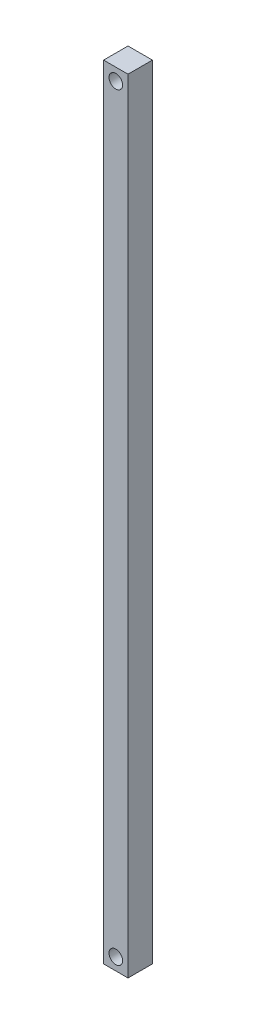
ISO-10303-21;
HEADER;
FILE_DESCRIPTION(('STEP AP214'),'2;1');
FILE_NAME('part.step','',(''),(''),'','','');
FILE_SCHEMA(('AUTOMOTIVE_DESIGN { 1 0 10303 214 1 1 1 1 }'));
ENDSEC;
DATA;
#1=APPLICATION_CONTEXT('core data for automotive mechanical design processes');
#2=APPLICATION_PROTOCOL_DEFINITION('international standard','automotive_design',2000,#1);
#3=PRODUCT_CONTEXT('',#1,'mechanical');
#4=PRODUCT('Part','Part','',(#3));
#5=PRODUCT_RELATED_PRODUCT_CATEGORY('part','',(#4));
#6=PRODUCT_DEFINITION_FORMATION('','',#4);
#7=PRODUCT_DEFINITION_CONTEXT('part definition',#1,'design');
#8=PRODUCT_DEFINITION('design','',#6,#7);
#9=PRODUCT_DEFINITION_SHAPE('','',#8);
#10=(LENGTH_UNIT() NAMED_UNIT(*) SI_UNIT(.MILLI.,.METRE.));
#11=(NAMED_UNIT(*) PLANE_ANGLE_UNIT() SI_UNIT($,.RADIAN.));
#12=(NAMED_UNIT(*) SI_UNIT($,.STERADIAN.) SOLID_ANGLE_UNIT());
#13=UNCERTAINTY_MEASURE_WITH_UNIT(LENGTH_MEASURE(1.E-05),#10,'distance_accuracy_value','');
#14=(GEOMETRIC_REPRESENTATION_CONTEXT(3) GLOBAL_UNCERTAINTY_ASSIGNED_CONTEXT((#13)) GLOBAL_UNIT_ASSIGNED_CONTEXT((#10,
#11,#12)) REPRESENTATION_CONTEXT('',''));
#15=CARTESIAN_POINT('',(0.,0.,0.));
#16=DIRECTION('',(0.,0.,1.));
#17=DIRECTION('',(1.,0.,0.));
#18=AXIS2_PLACEMENT_3D('',#15,#16,#17);
#19=CARTESIAN_POINT('',(0.,0.,18.7));
#20=DIRECTION('',(0.,0.,-1.));
#21=DIRECTION('',(-1.,0.,0.));
#22=AXIS2_PLACEMENT_3D('',#19,#20,#21);
#23=PLANE('',#22);
#24=DIRECTION('',(0.,-1.,0.));
#25=VECTOR('',#24,1.);
#26=CARTESIAN_POINT('',(-3.76965671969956,0.,18.7));
#27=LINE('',#26,#25);
#28=CARTESIAN_POINT('',(-3.76965671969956,600.,18.7));
#29=VERTEX_POINT('',#28);
#30=CARTESIAN_POINT('',(-3.76965671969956,0.,18.7));
#31=VERTEX_POINT('',#30);
#32=EDGE_CURVE('E98',#29,#31,#27,.T.);
#33=ORIENTED_EDGE('',*,*,#32,.T.);
#34=DIRECTION('',(1.,0.,0.));
#35=VECTOR('',#34,1.);
#36=CARTESIAN_POINT('',(-3.76965671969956,0.,18.7));
#37=LINE('',#36,#35);
#38=CARTESIAN_POINT('',(14.9303432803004,0.,18.7));
#39=VERTEX_POINT('',#38);
#40=EDGE_CURVE('E93',#31,#39,#37,.T.);
#41=ORIENTED_EDGE('',*,*,#40,.T.);
#42=DIRECTION('',(0.,1.,0.));
#43=VECTOR('',#42,1.);
#44=CARTESIAN_POINT('',(14.9303432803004,0.,18.7));
#45=LINE('',#44,#43);
#46=CARTESIAN_POINT('',(14.9303432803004,600.,18.7));
#47=VERTEX_POINT('',#46);
#48=EDGE_CURVE('E96',#39,#47,#45,.T.);
#49=ORIENTED_EDGE('',*,*,#48,.T.);
#50=DIRECTION('',(-1.,0.,0.));
#51=VECTOR('',#50,1.);
#52=CARTESIAN_POINT('',(-3.76965671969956,600.,18.7));
#53=LINE('',#52,#51);
#54=EDGE_CURVE('E63',#47,#29,#53,.T.);
#55=ORIENTED_EDGE('',*,*,#54,.T.);
#56=EDGE_LOOP('',(#33,#41,#49,#55));
#57=FACE_BOUND('',#56,.T.);
#58=CARTESIAN_POINT('',(5.58034328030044,590.65,18.7));
#59=DIRECTION('',(0.,0.,1.));
#60=DIRECTION('',(1.,0.,0.));
#61=AXIS2_PLACEMENT_3D('',#58,#59,#60);
#62=CIRCLE('',#61,5.19999999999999);
#63=CARTESIAN_POINT('',(10.7803432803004,590.65,18.7));
#64=VERTEX_POINT('',#63);
#65=EDGE_CURVE('E118',#64,#64,#62,.T.);
#66=ORIENTED_EDGE('',*,*,#65,.F.);
#67=EDGE_LOOP('',(#66));
#68=FACE_BOUND('',#67,.T.);
#69=CARTESIAN_POINT('',(5.58034328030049,9.35,18.7));
#70=DIRECTION('',(0.,0.,1.));
#71=DIRECTION('',(1.,0.,0.));
#72=AXIS2_PLACEMENT_3D('',#69,#70,#71);
#73=CIRCLE('',#72,5.2);
#74=CARTESIAN_POINT('',(10.7803432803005,9.35,18.7));
#75=VERTEX_POINT('',#74);
#76=EDGE_CURVE('E140',#75,#75,#73,.T.);
#77=ORIENTED_EDGE('',*,*,#76,.F.);
#78=EDGE_LOOP('',(#77));
#79=FACE_BOUND('',#78,.T.);
#80=ADVANCED_FACE('F45',(#57,#68,#79),#23,.F.);
#81=CARTESIAN_POINT('',(0.,0.,0.));
#82=DIRECTION('',(0.,0.,-1.));
#83=DIRECTION('',(-1.,0.,0.));
#84=AXIS2_PLACEMENT_3D('',#81,#82,#83);
#85=PLANE('',#84);
#86=CARTESIAN_POINT('',(5.58034328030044,590.65,0.));
#87=DIRECTION('',(0.,0.,1.));
#88=DIRECTION('',(1.,0.,0.));
#89=AXIS2_PLACEMENT_3D('',#86,#87,#88);
#90=CIRCLE('',#89,5.19999999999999);
#91=CARTESIAN_POINT('',(10.7803432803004,590.65,0.));
#92=VERTEX_POINT('',#91);
#93=EDGE_CURVE('E136',#92,#92,#90,.T.);
#94=ORIENTED_EDGE('',*,*,#93,.T.);
#95=EDGE_LOOP('',(#94));
#96=FACE_BOUND('',#95,.T.);
#97=DIRECTION('',(0.,-1.,0.));
#98=VECTOR('',#97,1.);
#99=CARTESIAN_POINT('',(-3.76965671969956,0.,0.));
#100=LINE('',#99,#98);
#101=CARTESIAN_POINT('',(-3.76965671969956,600.,0.));
#102=VERTEX_POINT('',#101);
#103=CARTESIAN_POINT('',(-3.76965671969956,0.,0.));
#104=VERTEX_POINT('',#103);
#105=EDGE_CURVE('E114',#102,#104,#100,.T.);
#106=ORIENTED_EDGE('',*,*,#105,.F.);
#107=DIRECTION('',(-1.,0.,0.));
#108=VECTOR('',#107,1.);
#109=CARTESIAN_POINT('',(-3.76965671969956,600.,0.));
#110=LINE('',#109,#108);
#111=CARTESIAN_POINT('',(14.9303432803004,600.,0.));
#112=VERTEX_POINT('',#111);
#113=EDGE_CURVE('E86',#112,#102,#110,.T.);
#114=ORIENTED_EDGE('',*,*,#113,.F.);
#115=DIRECTION('',(0.,1.,0.));
#116=VECTOR('',#115,1.);
#117=CARTESIAN_POINT('',(14.9303432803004,0.,0.));
#118=LINE('',#117,#116);
#119=CARTESIAN_POINT('',(14.9303432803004,0.,0.));
#120=VERTEX_POINT('',#119);
#121=EDGE_CURVE('E80',#120,#112,#118,.T.);
#122=ORIENTED_EDGE('',*,*,#121,.F.);
#123=DIRECTION('',(1.,0.,0.));
#124=VECTOR('',#123,1.);
#125=CARTESIAN_POINT('',(-3.76965671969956,0.,0.));
#126=LINE('',#125,#124);
#127=EDGE_CURVE('E103',#104,#120,#126,.T.);
#128=ORIENTED_EDGE('',*,*,#127,.F.);
#129=EDGE_LOOP('',(#106,#114,#122,#128));
#130=FACE_BOUND('',#129,.T.);
#131=CARTESIAN_POINT('',(5.58034328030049,9.35,0.));
#132=DIRECTION('',(0.,0.,1.));
#133=DIRECTION('',(1.,0.,0.));
#134=AXIS2_PLACEMENT_3D('',#131,#132,#133);
#135=CIRCLE('',#134,5.2);
#136=CARTESIAN_POINT('',(10.7803432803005,9.35,0.));
#137=VERTEX_POINT('',#136);
#138=EDGE_CURVE('E144',#137,#137,#135,.T.);
#139=ORIENTED_EDGE('',*,*,#138,.T.);
#140=EDGE_LOOP('',(#139));
#141=FACE_BOUND('',#140,.T.);
#142=ADVANCED_FACE('F131',(#96,#130,#141),#85,.T.);
#143=CARTESIAN_POINT('',(-3.76965671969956,0.,18.7));
#144=DIRECTION('',(1.,0.,0.));
#145=DIRECTION('',(0.,0.,-1.));
#146=AXIS2_PLACEMENT_3D('',#143,#144,#145);
#147=PLANE('',#146);
#148=ORIENTED_EDGE('',*,*,#105,.T.);
#149=DIRECTION('',(0.,0.,-1.));
#150=VECTOR('',#149,1.);
#151=CARTESIAN_POINT('',(-3.76965671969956,0.,18.7));
#152=LINE('',#151,#150);
#153=EDGE_CURVE('E11',#31,#104,#152,.T.);
#154=ORIENTED_EDGE('',*,*,#153,.F.);
#155=ORIENTED_EDGE('',*,*,#32,.F.);
#156=DIRECTION('',(0.,0.,-1.));
#157=VECTOR('',#156,1.);
#158=CARTESIAN_POINT('',(-3.76965671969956,600.,18.7));
#159=LINE('',#158,#157);
#160=EDGE_CURVE('E110',#29,#102,#159,.T.);
#161=ORIENTED_EDGE('',*,*,#160,.T.);
#162=EDGE_LOOP('',(#148,#154,#155,#161));
#163=FACE_BOUND('',#162,.T.);
#164=ADVANCED_FACE('F47',(#163),#147,.F.);
#165=CARTESIAN_POINT('',(-3.76965671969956,0.,18.7));
#166=DIRECTION('',(0.,1.,0.));
#167=DIRECTION('',(0.,0.,1.));
#168=AXIS2_PLACEMENT_3D('',#165,#166,#167);
#169=PLANE('',#168);
#170=ORIENTED_EDGE('',*,*,#127,.T.);
#171=DIRECTION('',(0.,0.,-1.));
#172=VECTOR('',#171,1.);
#173=CARTESIAN_POINT('',(14.9303432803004,0.,18.7));
#174=LINE('',#173,#172);
#175=EDGE_CURVE('E55',#39,#120,#174,.T.);
#176=ORIENTED_EDGE('',*,*,#175,.F.);
#177=ORIENTED_EDGE('',*,*,#40,.F.);
#178=ORIENTED_EDGE('',*,*,#153,.T.);
#179=EDGE_LOOP('',(#170,#176,#177,#178));
#180=FACE_BOUND('',#179,.T.);
#181=ADVANCED_FACE('F102',(#180),#169,.F.);
#182=CARTESIAN_POINT('',(14.9303432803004,0.,18.7));
#183=DIRECTION('',(-1.,0.,0.));
#184=DIRECTION('',(0.,0.,1.));
#185=AXIS2_PLACEMENT_3D('',#182,#183,#184);
#186=PLANE('',#185);
#187=ORIENTED_EDGE('',*,*,#121,.T.);
#188=DIRECTION('',(0.,0.,-1.));
#189=VECTOR('',#188,1.);
#190=CARTESIAN_POINT('',(14.9303432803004,600.,18.7));
#191=LINE('',#190,#189);
#192=EDGE_CURVE('E105',#47,#112,#191,.T.);
#193=ORIENTED_EDGE('',*,*,#192,.F.);
#194=ORIENTED_EDGE('',*,*,#48,.F.);
#195=ORIENTED_EDGE('',*,*,#175,.T.);
#196=EDGE_LOOP('',(#187,#193,#194,#195));
#197=FACE_BOUND('',#196,.T.);
#198=ADVANCED_FACE('F106',(#197),#186,.F.);
#199=CARTESIAN_POINT('',(-3.76965671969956,600.,18.7));
#200=DIRECTION('',(0.,-1.,0.));
#201=DIRECTION('',(0.,0.,-1.));
#202=AXIS2_PLACEMENT_3D('',#199,#200,#201);
#203=PLANE('',#202);
#204=ORIENTED_EDGE('',*,*,#113,.T.);
#205=ORIENTED_EDGE('',*,*,#160,.F.);
#206=ORIENTED_EDGE('',*,*,#54,.F.);
#207=ORIENTED_EDGE('',*,*,#192,.T.);
#208=EDGE_LOOP('',(#204,#205,#206,#207));
#209=FACE_BOUND('',#208,.T.);
#210=ADVANCED_FACE('F128',(#209),#203,.F.);
#211=CARTESIAN_POINT('',(5.58034328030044,590.65,18.7));
#212=DIRECTION('',(0.,0.,-1.));
#213=DIRECTION('',(-1.,0.,0.));
#214=AXIS2_PLACEMENT_3D('',#211,#212,#213);
#215=CYLINDRICAL_SURFACE('',#214,5.19999999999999);
#216=ORIENTED_EDGE('',*,*,#65,.T.);
#217=EDGE_LOOP('',(#216));
#218=FACE_BOUND('',#217,.T.);
#219=ORIENTED_EDGE('',*,*,#93,.F.);
#220=EDGE_LOOP('',(#219));
#221=FACE_BOUND('',#220,.T.);
#222=ADVANCED_FACE('F163',(#218,#221),#215,.F.);
#223=CARTESIAN_POINT('',(5.58034328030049,9.35,18.7));
#224=DIRECTION('',(0.,0.,-1.));
#225=DIRECTION('',(-1.,0.,0.));
#226=AXIS2_PLACEMENT_3D('',#223,#224,#225);
#227=CYLINDRICAL_SURFACE('',#226,5.2);
#228=ORIENTED_EDGE('',*,*,#76,.T.);
#229=EDGE_LOOP('',(#228));
#230=FACE_BOUND('',#229,.T.);
#231=ORIENTED_EDGE('',*,*,#138,.F.);
#232=EDGE_LOOP('',(#231));
#233=FACE_BOUND('',#232,.T.);
#234=ADVANCED_FACE('F152',(#230,#233),#227,.F.);
#235=CLOSED_SHELL('',(#80,#142,#164,#181,#198,#210,#222,#234));
#236=MANIFOLD_SOLID_BREP('B2',#235);
#237=ADVANCED_BREP_SHAPE_REPRESENTATION('',(#18,#236),#14);
#238=SHAPE_DEFINITION_REPRESENTATION(#9,#237);
ENDSEC;
END-ISO-10303-21;
